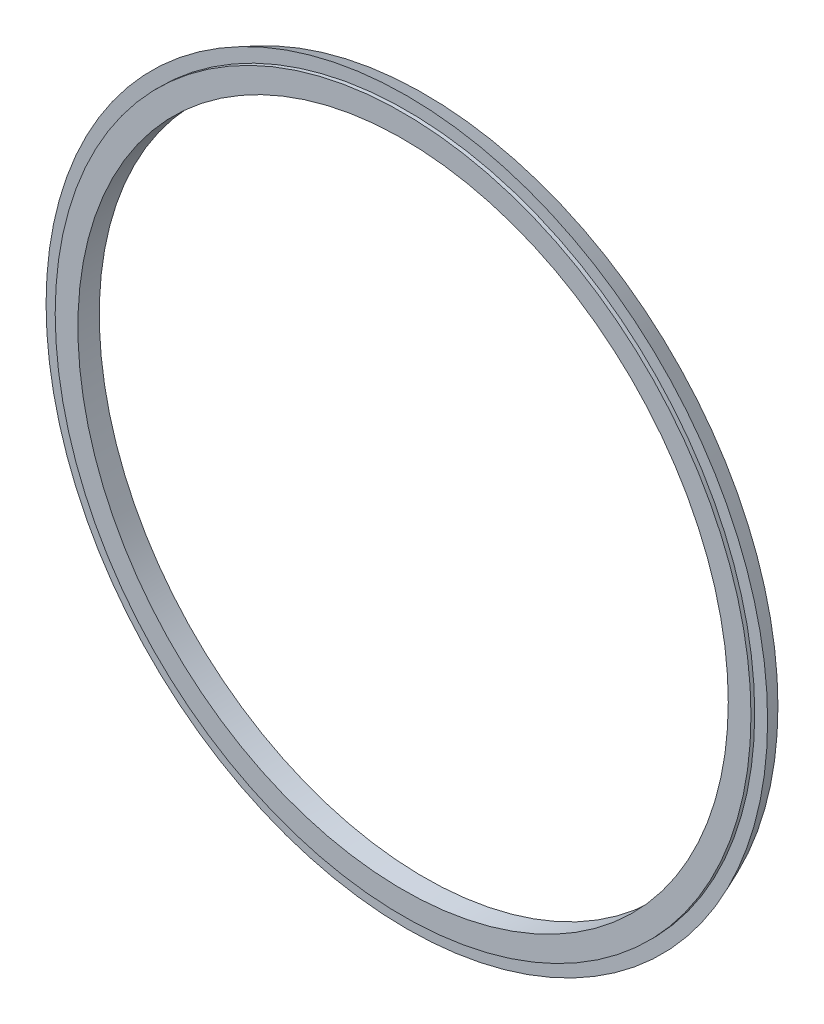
ISO-10303-21;
HEADER;
FILE_DESCRIPTION(('STEP AP214'),'2;1');
FILE_NAME('part.step','',(''),(''),'','','');
FILE_SCHEMA(('AUTOMOTIVE_DESIGN { 1 0 10303 214 1 1 1 1 }'));
ENDSEC;
DATA;
#1=APPLICATION_CONTEXT('core data for automotive mechanical design processes');
#2=APPLICATION_PROTOCOL_DEFINITION('international standard','automotive_design',2000,#1);
#3=PRODUCT_CONTEXT('',#1,'mechanical');
#4=PRODUCT('Part','Part','',(#3));
#5=PRODUCT_RELATED_PRODUCT_CATEGORY('part','',(#4));
#6=PRODUCT_DEFINITION_FORMATION('','',#4);
#7=PRODUCT_DEFINITION_CONTEXT('part definition',#1,'design');
#8=PRODUCT_DEFINITION('design','',#6,#7);
#9=PRODUCT_DEFINITION_SHAPE('','',#8);
#10=(LENGTH_UNIT() NAMED_UNIT(*) SI_UNIT(.MILLI.,.METRE.));
#11=(NAMED_UNIT(*) PLANE_ANGLE_UNIT() SI_UNIT($,.RADIAN.));
#12=(NAMED_UNIT(*) SI_UNIT($,.STERADIAN.) SOLID_ANGLE_UNIT());
#13=UNCERTAINTY_MEASURE_WITH_UNIT(LENGTH_MEASURE(1.E-05),#10,'distance_accuracy_value','');
#14=(GEOMETRIC_REPRESENTATION_CONTEXT(3) GLOBAL_UNCERTAINTY_ASSIGNED_CONTEXT((#13)) GLOBAL_UNIT_ASSIGNED_CONTEXT((#10,
#11,#12)) REPRESENTATION_CONTEXT('',''));
#15=CARTESIAN_POINT('',(0.,0.,0.));
#16=DIRECTION('',(0.,0.,1.));
#17=DIRECTION('',(1.,0.,0.));
#18=AXIS2_PLACEMENT_3D('',#15,#16,#17);
#19=CARTESIAN_POINT('',(0.,94.0211175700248,-33.0798884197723));
#20=DIRECTION('',(0.,0.,-1.));
#21=DIRECTION('',(-1.,0.,0.));
#22=AXIS2_PLACEMENT_3D('',#19,#20,#21);
#23=PLANE('',#22);
#24=CARTESIAN_POINT('',(0.,0.,-33.0798884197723));
#25=DIRECTION('',(0.,0.,1.));
#26=DIRECTION('',(1.,0.,0.));
#27=AXIS2_PLACEMENT_3D('',#24,#25,#26);
#28=CIRCLE('',#27,87.8897425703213);
#29=CARTESIAN_POINT('',(87.8897425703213,0.,-33.0798884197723));
#30=VERTEX_POINT('',#29);
#31=EDGE_CURVE('E71',#30,#30,#28,.T.);
#32=ORIENTED_EDGE('',*,*,#31,.F.);
#33=EDGE_LOOP('',(#32));
#34=FACE_BOUND('',#33,.T.);
#35=CARTESIAN_POINT('',(0.,0.,-33.0798884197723));
#36=DIRECTION('',(0.,0.,1.));
#37=DIRECTION('',(1.,0.,0.));
#38=AXIS2_PLACEMENT_3D('',#35,#36,#37);
#39=CIRCLE('',#38,94.0211175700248);
#40=CARTESIAN_POINT('',(94.0211175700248,0.,-33.0798884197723));
#41=VERTEX_POINT('',#40);
#42=EDGE_CURVE('E10',#41,#41,#39,.T.);
#43=ORIENTED_EDGE('',*,*,#42,.T.);
#44=EDGE_LOOP('',(#43));
#45=FACE_BOUND('',#44,.T.);
#46=ADVANCED_FACE('F31',(#34,#45),#23,.F.);
#47=CARTESIAN_POINT('',(0.,0.,5.07999999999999));
#48=DIRECTION('',(0.,0.,1.));
#49=DIRECTION('',(1.,0.,0.));
#50=AXIS2_PLACEMENT_3D('',#47,#48,#49);
#51=CYLINDRICAL_SURFACE('',#50,94.0211175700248);
#52=ORIENTED_EDGE('',*,*,#42,.F.);
#53=EDGE_LOOP('',(#52));
#54=FACE_BOUND('',#53,.T.);
#55=CARTESIAN_POINT('',(0.,0.,-34.0958884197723));
#56=DIRECTION('',(0.,0.,1.));
#57=DIRECTION('',(1.,0.,0.));
#58=AXIS2_PLACEMENT_3D('',#55,#56,#57);
#59=CIRCLE('',#58,94.0211175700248);
#60=CARTESIAN_POINT('',(94.0211175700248,0.,-34.0958884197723));
#61=VERTEX_POINT('',#60);
#62=EDGE_CURVE('E37',#61,#61,#59,.T.);
#63=ORIENTED_EDGE('',*,*,#62,.T.);
#64=EDGE_LOOP('',(#63));
#65=FACE_BOUND('',#64,.T.);
#66=ADVANCED_FACE('F78',(#54,#65),#51,.T.);
#67=CARTESIAN_POINT('',(0.,94.0211175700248,-34.0958884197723));
#68=DIRECTION('',(0.,0.,1.));
#69=DIRECTION('',(1.,0.,0.));
#70=AXIS2_PLACEMENT_3D('',#67,#68,#69);
#71=PLANE('',#70);
#72=CARTESIAN_POINT('',(0.,0.,-34.0958884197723));
#73=DIRECTION('',(0.,0.,1.));
#74=DIRECTION('',(1.,0.,0.));
#75=AXIS2_PLACEMENT_3D('',#72,#73,#74);
#76=CIRCLE('',#75,97.5034380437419);
#77=CARTESIAN_POINT('',(97.5034380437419,0.,-34.0958884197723));
#78=VERTEX_POINT('',#77);
#79=EDGE_CURVE('E41',#78,#78,#76,.T.);
#80=ORIENTED_EDGE('',*,*,#79,.T.);
#81=EDGE_LOOP('',(#80));
#82=FACE_BOUND('',#81,.T.);
#83=ORIENTED_EDGE('',*,*,#62,.F.);
#84=EDGE_LOOP('',(#83));
#85=FACE_BOUND('',#84,.T.);
#86=ADVANCED_FACE('F82',(#82,#85),#71,.T.);
#87=CARTESIAN_POINT('',(0.,0.,-34.0958884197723));
#88=DIRECTION('',(0.,0.,1.));
#89=DIRECTION('',(1.,0.,0.));
#90=AXIS2_PLACEMENT_3D('',#87,#88,#89);
#91=CONICAL_SURFACE('',#90,97.5034380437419,0.392699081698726);
#92=CARTESIAN_POINT('',(0.,0.,-38.8583884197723));
#93=DIRECTION('',(0.,0.,1.));
#94=DIRECTION('',(1.,0.,0.));
#95=AXIS2_PLACEMENT_3D('',#92,#93,#94);
#96=CIRCLE('',#95,95.53074595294);
#97=CARTESIAN_POINT('',(95.53074595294,0.,-38.8583884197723));
#98=VERTEX_POINT('',#97);
#99=EDGE_CURVE('E45',#98,#98,#96,.T.);
#100=ORIENTED_EDGE('',*,*,#99,.T.);
#101=EDGE_LOOP('',(#100));
#102=FACE_BOUND('',#101,.T.);
#103=ORIENTED_EDGE('',*,*,#79,.F.);
#104=EDGE_LOOP('',(#103));
#105=FACE_BOUND('',#104,.T.);
#106=ADVANCED_FACE('F87',(#102,#105),#91,.T.);
#107=CARTESIAN_POINT('',(0.,95.53074595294,-38.8583884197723));
#108=DIRECTION('',(0.,0.,-1.));
#109=DIRECTION('',(-1.,0.,0.));
#110=AXIS2_PLACEMENT_3D('',#107,#108,#109);
#111=PLANE('',#110);
#112=CARTESIAN_POINT('',(0.,0.,-38.8583884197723));
#113=DIRECTION('',(0.,0.,1.));
#114=DIRECTION('',(1.,0.,0.));
#115=AXIS2_PLACEMENT_3D('',#112,#113,#114);
#116=CIRCLE('',#115,93.3491457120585);
#117=CARTESIAN_POINT('',(93.3491457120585,0.,-38.8583884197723));
#118=VERTEX_POINT('',#117);
#119=EDGE_CURVE('E50',#118,#118,#116,.T.);
#120=ORIENTED_EDGE('',*,*,#119,.T.);
#121=EDGE_LOOP('',(#120));
#122=FACE_BOUND('',#121,.T.);
#123=ORIENTED_EDGE('',*,*,#99,.F.);
#124=EDGE_LOOP('',(#123));
#125=FACE_BOUND('',#124,.T.);
#126=ADVANCED_FACE('F93',(#122,#125),#111,.T.);
#127=CARTESIAN_POINT('',(0.,0.,-38.8583884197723));
#128=DIRECTION('',(0.,0.,1.));
#129=DIRECTION('',(1.,0.,0.));
#130=AXIS2_PLACEMENT_3D('',#127,#128,#129);
#131=CONICAL_SURFACE('',#130,93.3491457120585,0.261799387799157);
#132=CARTESIAN_POINT('',(0.,0.,-36.6127284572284));
#133=DIRECTION('',(0.,0.,1.));
#134=DIRECTION('',(1.,0.,0.));
#135=AXIS2_PLACEMENT_3D('',#132,#133,#134);
#136=CIRCLE('',#135,93.950868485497);
#137=CARTESIAN_POINT('',(93.950868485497,0.,-36.6127284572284));
#138=VERTEX_POINT('',#137);
#139=EDGE_CURVE('E53',#138,#138,#136,.T.);
#140=ORIENTED_EDGE('',*,*,#139,.T.);
#141=EDGE_LOOP('',(#140));
#142=FACE_BOUND('',#141,.T.);
#143=ORIENTED_EDGE('',*,*,#119,.F.);
#144=EDGE_LOOP('',(#143));
#145=FACE_BOUND('',#144,.T.);
#146=ADVANCED_FACE('F97',(#142,#145),#131,.F.);
#147=CARTESIAN_POINT('',(0.,0.,-36.5469884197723));
#148=DIRECTION('',(0.,0.,1.));
#149=DIRECTION('',(1.,0.,0.));
#150=AXIS2_PLACEMENT_3D('',#147,#148,#149);
#151=TOROIDAL_SURFACE('',#150,93.7055233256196,0.254);
#152=CARTESIAN_POINT('',(0.,0.,-36.2929884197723));
#153=DIRECTION('',(0.,0.,1.));
#154=DIRECTION('',(1.,0.,0.));
#155=AXIS2_PLACEMENT_3D('',#152,#153,#154);
#156=CIRCLE('',#155,93.7055233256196);
#157=CARTESIAN_POINT('',(93.7055233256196,0.,-36.2929884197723));
#158=VERTEX_POINT('',#157);
#159=EDGE_CURVE('E56',#158,#158,#156,.T.);
#160=ORIENTED_EDGE('',*,*,#159,.T.);
#161=EDGE_LOOP('',(#160));
#162=FACE_BOUND('',#161,.T.);
#163=ORIENTED_EDGE('',*,*,#139,.F.);
#164=EDGE_LOOP('',(#163));
#165=FACE_BOUND('',#164,.T.);
#166=ADVANCED_FACE('F101',(#162,#165),#151,.F.);
#167=CARTESIAN_POINT('',(0.,93.7055233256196,-36.2929884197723));
#168=DIRECTION('',(0.,0.,-1.));
#169=DIRECTION('',(-1.,0.,0.));
#170=AXIS2_PLACEMENT_3D('',#167,#168,#169);
#171=PLANE('',#170);
#172=CARTESIAN_POINT('',(0.,0.,-36.2929884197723));
#173=DIRECTION('',(0.,0.,1.));
#174=DIRECTION('',(1.,0.,0.));
#175=AXIS2_PLACEMENT_3D('',#172,#173,#174);
#176=CIRCLE('',#175,90.1757425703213);
#177=CARTESIAN_POINT('',(90.1757425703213,0.,-36.2929884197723));
#178=VERTEX_POINT('',#177);
#179=EDGE_CURVE('E59',#178,#178,#176,.T.);
#180=ORIENTED_EDGE('',*,*,#179,.T.);
#181=EDGE_LOOP('',(#180));
#182=FACE_BOUND('',#181,.T.);
#183=ORIENTED_EDGE('',*,*,#159,.F.);
#184=EDGE_LOOP('',(#183));
#185=FACE_BOUND('',#184,.T.);
#186=ADVANCED_FACE('F105',(#182,#185),#171,.T.);
#187=CARTESIAN_POINT('',(0.,0.,-36.5469884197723));
#188=DIRECTION('',(0.,0.,1.));
#189=DIRECTION('',(1.,0.,0.));
#190=AXIS2_PLACEMENT_3D('',#187,#188,#189);
#191=TOROIDAL_SURFACE('',#190,90.1757425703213,0.254000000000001);
#192=ORIENTED_EDGE('',*,*,#179,.F.);
#193=EDGE_LOOP('',(#192));
#194=FACE_BOUND('',#193,.T.);
#195=CARTESIAN_POINT('',(0.,0.,-36.5469884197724));
#196=DIRECTION('',(0.,0.,1.));
#197=DIRECTION('',(1.,0.,0.));
#198=AXIS2_PLACEMENT_3D('',#195,#196,#197);
#199=CIRCLE('',#198,89.9217425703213);
#200=CARTESIAN_POINT('',(89.9217425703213,0.,-36.5469884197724));
#201=VERTEX_POINT('',#200);
#202=EDGE_CURVE('E62',#201,#201,#199,.T.);
#203=ORIENTED_EDGE('',*,*,#202,.T.);
#204=EDGE_LOOP('',(#203));
#205=FACE_BOUND('',#204,.T.);
#206=ADVANCED_FACE('F109',(#194,#205),#191,.F.);
#207=CARTESIAN_POINT('',(0.,0.,5.07999999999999));
#208=DIRECTION('',(0.,0.,1.));
#209=DIRECTION('',(1.,0.,0.));
#210=AXIS2_PLACEMENT_3D('',#207,#208,#209);
#211=CYLINDRICAL_SURFACE('',#210,89.9217425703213);
#212=ORIENTED_EDGE('',*,*,#202,.F.);
#213=EDGE_LOOP('',(#212));
#214=FACE_BOUND('',#213,.T.);
#215=CARTESIAN_POINT('',(0.,0.,-38.8583884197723));
#216=DIRECTION('',(0.,0.,1.));
#217=DIRECTION('',(1.,0.,0.));
#218=AXIS2_PLACEMENT_3D('',#215,#216,#217);
#219=CIRCLE('',#218,89.9217425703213);
#220=CARTESIAN_POINT('',(89.9217425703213,0.,-38.8583884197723));
#221=VERTEX_POINT('',#220);
#222=EDGE_CURVE('E65',#221,#221,#219,.T.);
#223=ORIENTED_EDGE('',*,*,#222,.T.);
#224=EDGE_LOOP('',(#223));
#225=FACE_BOUND('',#224,.T.);
#226=ADVANCED_FACE('F113',(#214,#225),#211,.T.);
#227=CARTESIAN_POINT('',(0.,89.9217425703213,-38.8583884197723));
#228=DIRECTION('',(0.,0.,-1.));
#229=DIRECTION('',(-1.,0.,0.));
#230=AXIS2_PLACEMENT_3D('',#227,#228,#229);
#231=PLANE('',#230);
#232=CARTESIAN_POINT('',(0.,0.,-38.8583884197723));
#233=DIRECTION('',(0.,0.,1.));
#234=DIRECTION('',(1.,0.,0.));
#235=AXIS2_PLACEMENT_3D('',#232,#233,#234);
#236=CIRCLE('',#235,87.8897425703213);
#237=CARTESIAN_POINT('',(87.8897425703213,0.,-38.8583884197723));
#238=VERTEX_POINT('',#237);
#239=EDGE_CURVE('E68',#238,#238,#236,.T.);
#240=ORIENTED_EDGE('',*,*,#239,.T.);
#241=EDGE_LOOP('',(#240));
#242=FACE_BOUND('',#241,.T.);
#243=ORIENTED_EDGE('',*,*,#222,.F.);
#244=EDGE_LOOP('',(#243));
#245=FACE_BOUND('',#244,.T.);
#246=ADVANCED_FACE('F117',(#242,#245),#231,.T.);
#247=CARTESIAN_POINT('',(0.,0.,5.07999999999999));
#248=DIRECTION('',(0.,0.,1.));
#249=DIRECTION('',(1.,0.,0.));
#250=AXIS2_PLACEMENT_3D('',#247,#248,#249);
#251=CYLINDRICAL_SURFACE('',#250,87.8897425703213);
#252=ORIENTED_EDGE('',*,*,#239,.F.);
#253=EDGE_LOOP('',(#252));
#254=FACE_BOUND('',#253,.T.);
#255=ORIENTED_EDGE('',*,*,#31,.T.);
#256=EDGE_LOOP('',(#255));
#257=FACE_BOUND('',#256,.T.);
#258=ADVANCED_FACE('F75',(#254,#257),#251,.F.);
#259=CLOSED_SHELL('',(#46,#66,#86,#106,#126,#146,#166,#186,#206,#226,#246,#258));
#260=MANIFOLD_SOLID_BREP('B2',#259);
#261=ADVANCED_BREP_SHAPE_REPRESENTATION('',(#18,#260),#14);
#262=SHAPE_DEFINITION_REPRESENTATION(#9,#261);
ENDSEC;
END-ISO-10303-21;
